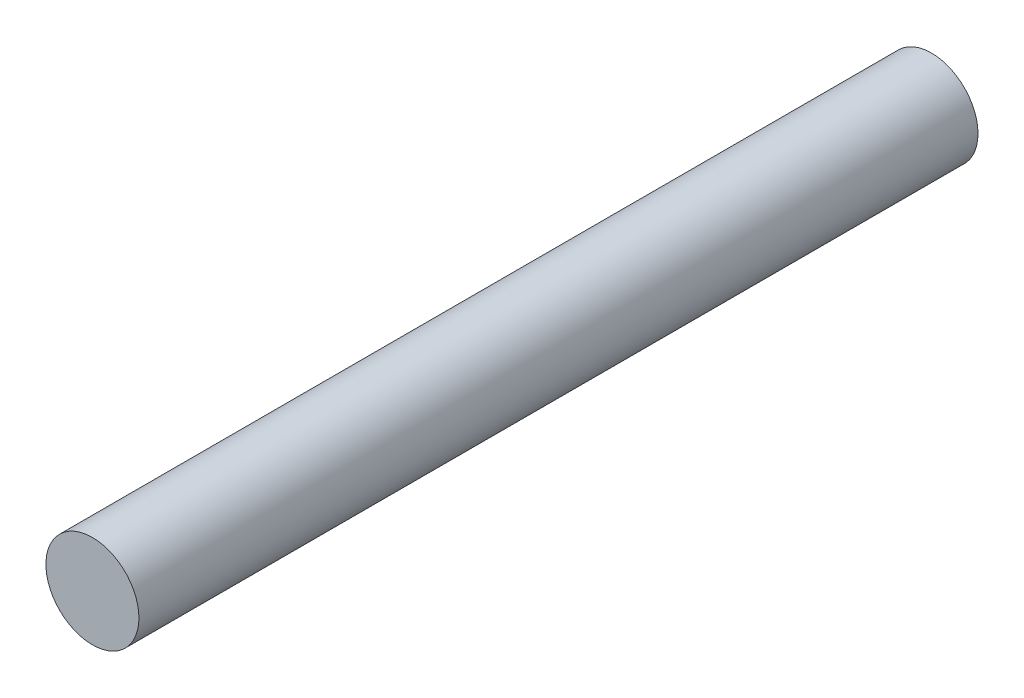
from build123d import *

# Parameters (mm, degrees)
SKETCH1_R           = 0.6477
BOSS_EXTRUDE1_DEPTH = 11.684


with BuildPart() as part:
    # Sketch1 → Boss-Extrude1 (new body)
    with BuildSketch(Plane.XY):
        Circle(SKETCH1_R)
    extrude(amount=BOSS_EXTRUDE1_DEPTH)


solid = part.part
